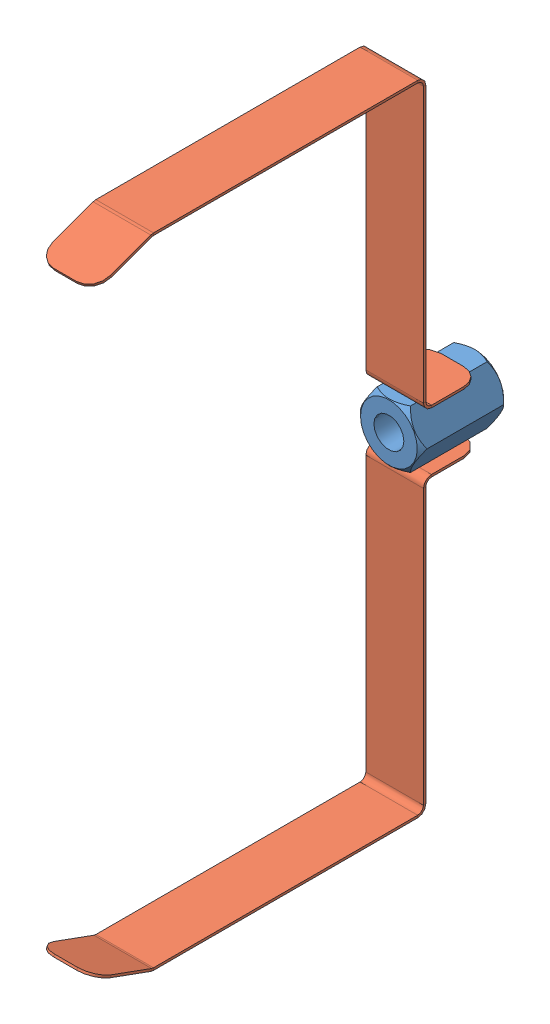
SolidWorks assembly Brise motte.SLDASM, configuration Défaut (file format 4100). Lengths in mm.
Overall size (12.7 110.8 71.14).
3 component instances, 2 part files, 6 mates.
Components (placement in the parent):
- Ecrou brise motte-1: Ecrou brise motte.SLDPRT [Défaut] at origin size (12.7 10 15)
- Lame brise motte-1: Lame brise motte.SLDPRT [Défaut] at (0 -5 -11) x (0 -1 0) z (-1 0 0) size (50.4 67.14 10)
- Lame brise motte-2: Lame brise motte.SLDPRT [Défaut] at (0 5 -11) x (0 1 0) z (1 0 0) size (50.4 67.14 10)
Mates (geometry in assembly coordinates):
- Coïncidente1: coincident anti-aligned: plane of Ecrou brise motte-1 through (-2.8868 -5 -15) normal (0 -1 0); plane of Lame brise motte-1 through (-5 -5 -11) normal (0 1 0)
- Coïncidente2: coincident anti-aligned: plane of Ecrou brise motte-1; plane of Lame brise motte-1
- A distance1: distance = 4 mm anti-aligned: plane of Ecrou brise motte-1; plane of Lame brise motte-1
- Coïncidente3: coincident anti-aligned: plane of Ecrou brise motte-1 through (-2.8868 5 -15) normal (0 1 0); plane of Lame brise motte-2
- Coïncidente4: coincident anti-aligned: plane of Lame brise motte-1; plane of Lame brise motte-2
- Coïncidente5: coincident aligned: sketch_entity of Lame brise motte-2
